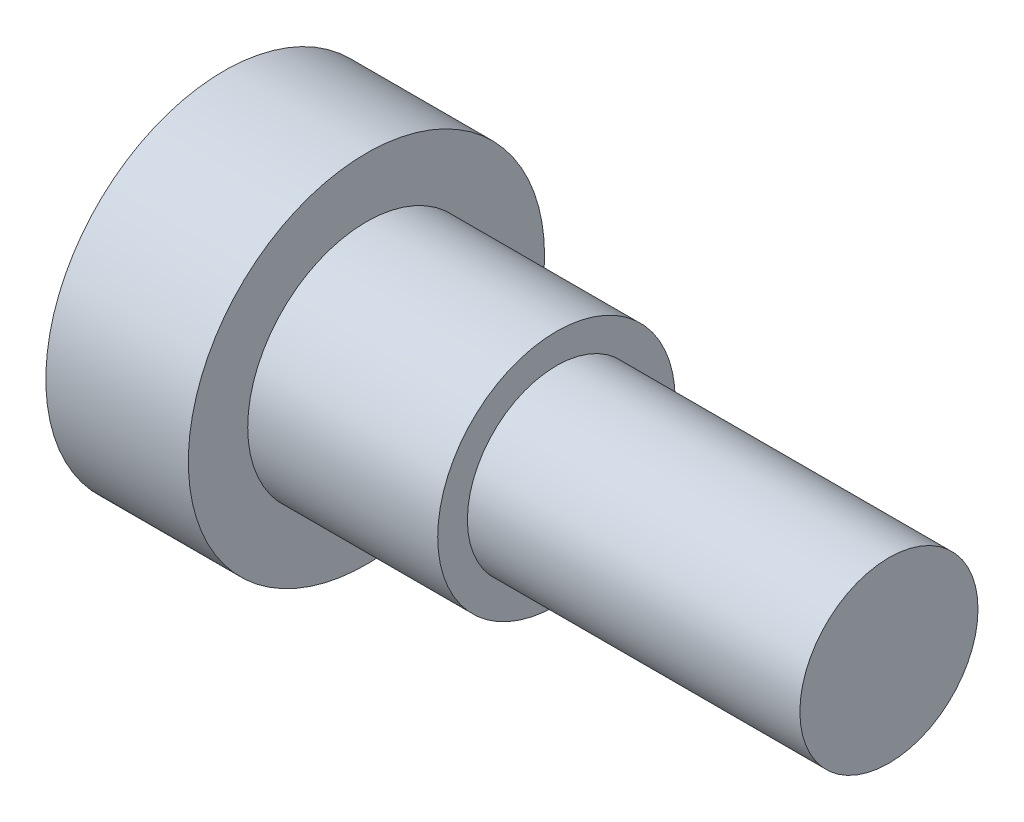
ISO-10303-21;
HEADER;
FILE_DESCRIPTION(('STEP AP214'),'2;1');
FILE_NAME('part.step','',(''),(''),'','','');
FILE_SCHEMA(('AUTOMOTIVE_DESIGN { 1 0 10303 214 1 1 1 1 }'));
ENDSEC;
DATA;
#1=APPLICATION_CONTEXT('core data for automotive mechanical design processes');
#2=APPLICATION_PROTOCOL_DEFINITION('international standard','automotive_design',2000,#1);
#3=PRODUCT_CONTEXT('',#1,'mechanical');
#4=PRODUCT('Part','Part','',(#3));
#5=PRODUCT_RELATED_PRODUCT_CATEGORY('part','',(#4));
#6=PRODUCT_DEFINITION_FORMATION('','',#4);
#7=PRODUCT_DEFINITION_CONTEXT('part definition',#1,'design');
#8=PRODUCT_DEFINITION('design','',#6,#7);
#9=PRODUCT_DEFINITION_SHAPE('','',#8);
#10=(LENGTH_UNIT() NAMED_UNIT(*) SI_UNIT(.MILLI.,.METRE.));
#11=(NAMED_UNIT(*) PLANE_ANGLE_UNIT() SI_UNIT($,.RADIAN.));
#12=(NAMED_UNIT(*) SI_UNIT($,.STERADIAN.) SOLID_ANGLE_UNIT());
#13=UNCERTAINTY_MEASURE_WITH_UNIT(LENGTH_MEASURE(1.E-05),#10,'distance_accuracy_value','');
#14=(GEOMETRIC_REPRESENTATION_CONTEXT(3) GLOBAL_UNCERTAINTY_ASSIGNED_CONTEXT((#13)) GLOBAL_UNIT_ASSIGNED_CONTEXT((#10,
#11,#12)) REPRESENTATION_CONTEXT('',''));
#15=CARTESIAN_POINT('',(0.,0.,0.));
#16=DIRECTION('',(0.,0.,1.));
#17=DIRECTION('',(1.,0.,0.));
#18=AXIS2_PLACEMENT_3D('',#15,#16,#17);
#19=CARTESIAN_POINT('',(0.,0.,0.));
#20=DIRECTION('',(-1.,0.,0.));
#21=DIRECTION('',(0.,0.,1.));
#22=AXIS2_PLACEMENT_3D('',#19,#20,#21);
#23=PLANE('',#22);
#24=CARTESIAN_POINT('',(0.,0.,0.));
#25=DIRECTION('',(1.,0.,0.));
#26=DIRECTION('',(0.,0.,-1.));
#27=AXIS2_PLACEMENT_3D('',#24,#25,#26);
#28=CIRCLE('',#27,37.5);
#29=CARTESIAN_POINT('',(0.,0.,-37.5));
#30=VERTEX_POINT('',#29);
#31=EDGE_CURVE('E10',#30,#30,#28,.T.);
#32=ORIENTED_EDGE('',*,*,#31,.F.);
#33=EDGE_LOOP('',(#32));
#34=FACE_BOUND('',#33,.T.);
#35=ADVANCED_FACE('F30',(#34),#23,.T.);
#36=CARTESIAN_POINT('',(0.,0.,0.));
#37=DIRECTION('',(1.,0.,0.));
#38=DIRECTION('',(0.,0.,-1.));
#39=AXIS2_PLACEMENT_3D('',#36,#37,#38);
#40=CYLINDRICAL_SURFACE('',#39,37.5);
#41=ORIENTED_EDGE('',*,*,#31,.T.);
#42=EDGE_LOOP('',(#41));
#43=FACE_BOUND('',#42,.T.);
#44=CARTESIAN_POINT('',(30.,0.,0.));
#45=DIRECTION('',(1.,0.,0.));
#46=DIRECTION('',(0.,0.,-1.));
#47=AXIS2_PLACEMENT_3D('',#44,#45,#46);
#48=CIRCLE('',#47,37.5);
#49=CARTESIAN_POINT('',(30.,0.,-37.5));
#50=VERTEX_POINT('',#49);
#51=EDGE_CURVE('E36',#50,#50,#48,.T.);
#52=ORIENTED_EDGE('',*,*,#51,.F.);
#53=EDGE_LOOP('',(#52));
#54=FACE_BOUND('',#53,.T.);
#55=ADVANCED_FACE('F72',(#43,#54),#40,.T.);
#56=CARTESIAN_POINT('',(30.,37.5,0.));
#57=DIRECTION('',(1.,0.,0.));
#58=DIRECTION('',(0.,0.,-1.));
#59=AXIS2_PLACEMENT_3D('',#56,#57,#58);
#60=PLANE('',#59);
#61=ORIENTED_EDGE('',*,*,#51,.T.);
#62=EDGE_LOOP('',(#61));
#63=FACE_BOUND('',#62,.T.);
#64=CARTESIAN_POINT('',(30.,0.,0.));
#65=DIRECTION('',(1.,0.,0.));
#66=DIRECTION('',(0.,0.,-1.));
#67=AXIS2_PLACEMENT_3D('',#64,#65,#66);
#68=CIRCLE('',#67,25.);
#69=CARTESIAN_POINT('',(30.,0.,-25.));
#70=VERTEX_POINT('',#69);
#71=EDGE_CURVE('E40',#70,#70,#68,.T.);
#72=ORIENTED_EDGE('',*,*,#71,.F.);
#73=EDGE_LOOP('',(#72));
#74=FACE_BOUND('',#73,.T.);
#75=ADVANCED_FACE('F77',(#63,#74),#60,.T.);
#76=CARTESIAN_POINT('',(0.,0.,0.));
#77=DIRECTION('',(1.,0.,0.));
#78=DIRECTION('',(0.,0.,-1.));
#79=AXIS2_PLACEMENT_3D('',#76,#77,#78);
#80=CYLINDRICAL_SURFACE('',#79,25.);
#81=ORIENTED_EDGE('',*,*,#71,.T.);
#82=EDGE_LOOP('',(#81));
#83=FACE_BOUND('',#82,.T.);
#84=CARTESIAN_POINT('',(70.,0.,0.));
#85=DIRECTION('',(1.,0.,0.));
#86=DIRECTION('',(0.,0.,-1.));
#87=AXIS2_PLACEMENT_3D('',#84,#85,#86);
#88=CIRCLE('',#87,25.);
#89=CARTESIAN_POINT('',(70.,0.,-25.));
#90=VERTEX_POINT('',#89);
#91=EDGE_CURVE('E44',#90,#90,#88,.T.);
#92=ORIENTED_EDGE('',*,*,#91,.F.);
#93=EDGE_LOOP('',(#92));
#94=FACE_BOUND('',#93,.T.);
#95=ADVANCED_FACE('F68',(#83,#94),#80,.T.);
#96=CARTESIAN_POINT('',(70.,25.,0.));
#97=DIRECTION('',(1.,0.,0.));
#98=DIRECTION('',(0.,0.,-1.));
#99=AXIS2_PLACEMENT_3D('',#96,#97,#98);
#100=PLANE('',#99);
#101=ORIENTED_EDGE('',*,*,#91,.T.);
#102=EDGE_LOOP('',(#101));
#103=FACE_BOUND('',#102,.T.);
#104=CARTESIAN_POINT('',(70.,0.,0.));
#105=DIRECTION('',(1.,0.,0.));
#106=DIRECTION('',(0.,0.,-1.));
#107=AXIS2_PLACEMENT_3D('',#104,#105,#106);
#108=CIRCLE('',#107,18.75);
#109=CARTESIAN_POINT('',(70.,0.,-18.75));
#110=VERTEX_POINT('',#109);
#111=EDGE_CURVE('E49',#110,#110,#108,.T.);
#112=ORIENTED_EDGE('',*,*,#111,.F.);
#113=EDGE_LOOP('',(#112));
#114=FACE_BOUND('',#113,.T.);
#115=ADVANCED_FACE('F60',(#103,#114),#100,.T.);
#116=CARTESIAN_POINT('',(0.,0.,0.));
#117=DIRECTION('',(1.,0.,0.));
#118=DIRECTION('',(0.,0.,-1.));
#119=AXIS2_PLACEMENT_3D('',#116,#117,#118);
#120=CYLINDRICAL_SURFACE('',#119,18.75);
#121=ORIENTED_EDGE('',*,*,#111,.T.);
#122=EDGE_LOOP('',(#121));
#123=FACE_BOUND('',#122,.T.);
#124=CARTESIAN_POINT('',(140.,0.,0.));
#125=DIRECTION('',(1.,0.,0.));
#126=DIRECTION('',(0.,0.,-1.));
#127=AXIS2_PLACEMENT_3D('',#124,#125,#126);
#128=CIRCLE('',#127,18.75);
#129=CARTESIAN_POINT('',(140.,0.,-18.75));
#130=VERTEX_POINT('',#129);
#131=EDGE_CURVE('E52',#130,#130,#128,.T.);
#132=ORIENTED_EDGE('',*,*,#131,.F.);
#133=EDGE_LOOP('',(#132));
#134=FACE_BOUND('',#133,.T.);
#135=ADVANCED_FACE('F58',(#123,#134),#120,.T.);
#136=CARTESIAN_POINT('',(140.,18.75,0.));
#137=DIRECTION('',(1.,0.,0.));
#138=DIRECTION('',(0.,0.,-1.));
#139=AXIS2_PLACEMENT_3D('',#136,#137,#138);
#140=PLANE('',#139);
#141=ORIENTED_EDGE('',*,*,#131,.T.);
#142=EDGE_LOOP('',(#141));
#143=FACE_BOUND('',#142,.T.);
#144=ADVANCED_FACE('F56',(#143),#140,.T.);
#145=CLOSED_SHELL('',(#35,#55,#75,#95,#115,#135,#144));
#146=MANIFOLD_SOLID_BREP('B2',#145);
#147=ADVANCED_BREP_SHAPE_REPRESENTATION('',(#18,#146),#14);
#148=SHAPE_DEFINITION_REPRESENTATION(#9,#147);
ENDSEC;
END-ISO-10303-21;
